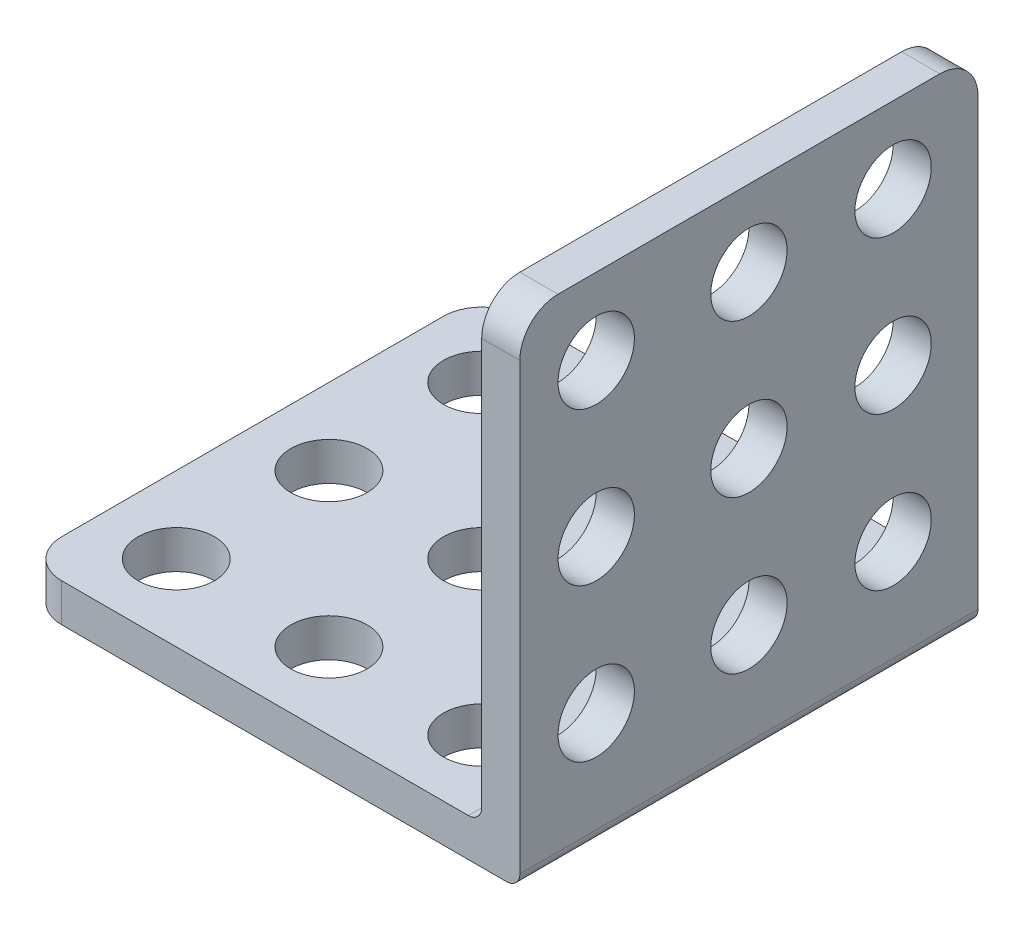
from build123d import *

# Parameters (mm, degrees)
SKETCH_1_W                       = 26
SKETCH_1_H                       = 24
EXTRUDE_1_DEPTH                  = 2
SKETCH_5_R                       = 2
CUT_EXTRUDE_4_DEPTH              = 36.440090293
SKETCH_2_W                       = 2
SKETCH_2_H                       = 24
EXTRUDE_4_DEPTH                  = 24
SKETCH_8_R                       = 2
CUT_EXTRUDE_5_DEPTH              = 43.755116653
PATTERN_LINEAR_1_COUNT           = 2
PATTERN_LINEAR_1_PITCH           = 8
PATTERN_LINEAR_2_COUNT           = 3
PATTERN_LINEAR_2_PITCH           = 8
PATTERN_LINEAR_2_COPY_1_SKETCH_R = 2
PATTERN_LINEAR_2_COPY_1_DEPTH    = 43.755116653
PATTERN_LINEAR_2_COPY_2_SKETCH_R = 2
PATTERN_LINEAR_2_COPY_2_DEPTH    = 43.755116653
FILLET_1_R                       = 2
FILLET_3_R                       = 0.7


with BuildPart() as part:
    # Sketch 1 → Extrude 1 (new body)
    with BuildSketch(Plane(origin=(0, 0, 0), x_dir=(1, 0, 0), z_dir=(0, 1, 0))):
        with Locations((13, -12)):
            Rectangle(SKETCH_1_W, SKETCH_1_H)
    extrude(amount=EXTRUDE_1_DEPTH)

    # Sketch 5 → Cut-Extrude 4 (cut, through all)
    with BuildSketch(Plane(origin=(0, 2, 0), x_dir=(1, 0, 0), z_dir=(0, 1, 0))):
        with Locations(Location((4, -12, 0), (0, 0, 270))):
            Circle(SKETCH_5_R)
        with Locations(Location((12, -12, 0), (0, 0, 270))):
            Circle(SKETCH_5_R)
        with Locations(Location((12, -4, 0), (0, 0, 270))):
            Circle(SKETCH_5_R)
        with Locations(Location((20, -4, 0), (0, 0, 270))):
            Circle(SKETCH_5_R)
        with Locations(Location((20, -12, 0), (0, 0, 270))):
            Circle(SKETCH_5_R)
        with Locations(Location((20, -20, 0), (0, 0, 270))):
            Circle(SKETCH_5_R)
        with Locations(Location((12, -20, 0), (0, 0, 270))):
            Circle(SKETCH_5_R)
        with Locations(Location((4, -20, 0), (0, 0, 270))):
            Circle(SKETCH_5_R)
        with Locations(Location((4, -4, 0), (0, 0, 270))):
            Circle(SKETCH_5_R)
    extrude(amount=-CUT_EXTRUDE_4_DEPTH, mode=Mode.SUBTRACT)

    # Sketch 2 → Extrude 4 (add)
    with BuildSketch(Plane(origin=(0, 2, 0), x_dir=(1, 0, 0), z_dir=(0, 1, 0))):
        with Locations((25, -12)):
            Rectangle(SKETCH_2_W, SKETCH_2_H)
    extrude(amount=EXTRUDE_4_DEPTH)

    # Sketch 8 → Cut-Extrude 5 (cut, through all)
    with BuildSketch(Plane.ZY.offset(-24)):
        with Locations((4.446708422, 22)):
            Circle(SKETCH_8_R)
        with Locations((20, 22)):
            Circle(SKETCH_8_R)
    cut_extrude_5 = extrude(amount=-CUT_EXTRUDE_5_DEPTH, mode=Mode.SUBTRACT)

    # Pattern Linear 1: Cut-Extrude 5 ×2
    with Locations(*[(0, 0, -i * PATTERN_LINEAR_1_PITCH) for i in range(1, PATTERN_LINEAR_1_COUNT)]):
        add(cut_extrude_5, mode=Mode.SUBTRACT)

    # Pattern Linear 2: Cut-Extrude 5 ×3
    with Locations(*[(0, -i * PATTERN_LINEAR_2_PITCH, 0) for i in range(1, PATTERN_LINEAR_2_COUNT)]):
        add(cut_extrude_5, mode=Mode.SUBTRACT)

    # Pattern Linear 2 copy 1 sketch → Pattern Linear 2 copy 1 (cut, through all)
    with BuildSketch(Plane(origin=(24, -8, -8), x_dir=(0, 0, 1), z_dir=(-1, 0, 0))):
        with Locations((4.446708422, 22)):
            Circle(PATTERN_LINEAR_2_COPY_1_SKETCH_R)
        with Locations((20, 22)):
            Circle(PATTERN_LINEAR_2_COPY_1_SKETCH_R)
    extrude(amount=-PATTERN_LINEAR_2_COPY_1_DEPTH, mode=Mode.SUBTRACT)

    # Pattern Linear 2 copy 2 sketch → Pattern Linear 2 copy 2 (cut, through all)
    with BuildSketch(Plane(origin=(24, -16, -8), x_dir=(0, 0, 1), z_dir=(-1, 0, 0))):
        with Locations((4.446708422, 22)):
            Circle(PATTERN_LINEAR_2_COPY_2_SKETCH_R)
        with Locations((20, 22)):
            Circle(PATTERN_LINEAR_2_COPY_2_SKETCH_R)
    extrude(amount=-PATTERN_LINEAR_2_COPY_2_DEPTH, mode=Mode.SUBTRACT)

    # Fillet 1
    fillet_1_edges = [part.edges().sort_by_distance(p)[0] for p in [
        (25, 26, 0),
        (25, 26, 24),
        (0, 1, 0),
        (0, 1, 24),
    ]]
    fillet(fillet_1_edges, radius=FILLET_1_R)

    # Fillet 3
    fillet_3_edges = [part.edges().sort_by_distance(p)[0] for p in [
        (26, 0, 12),
        (24, 2, 12),
    ]]
    fillet(fillet_3_edges, radius=FILLET_3_R)


solid = part.part
